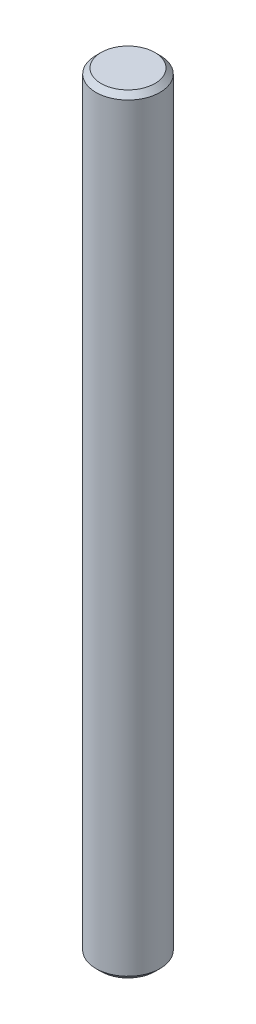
from build123d import *

# Parameters (mm, degrees)
SKETCH1_R      = 2.5
EXTRUDE1_DEPTH = 60
CHAMFER1_SIZE  = 0.4


with BuildPart() as part:
    # Sketch1 → Extrude1 (new body)
    with BuildSketch(Plane(origin=(0, 0, 0), x_dir=(1, 0, 0), z_dir=(0, 1, 0))):
        with Locations(Location((0, 0, 0), (0, 0, 270))):
            Circle(SKETCH1_R)
    extrude(amount=EXTRUDE1_DEPTH)

    # Chamfer1
    chamfer1_edges = [part.edges().sort_by_distance(p)[0] for p in [
        (0, 0, -2.5),
        (0, 60, -2.5),
    ]]
    chamfer(chamfer1_edges, length=CHAMFER1_SIZE)


solid = part.part
